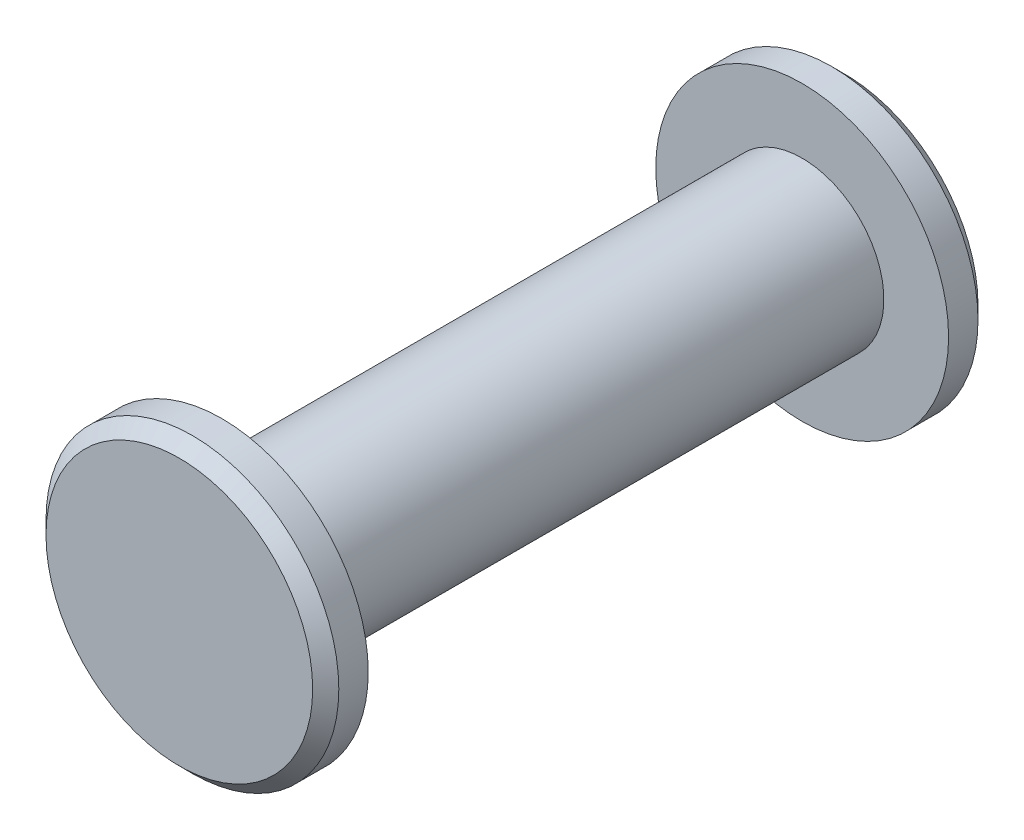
ISO-10303-21;
HEADER;
FILE_DESCRIPTION(('STEP AP214'),'2;1');
FILE_NAME('part.step','',(''),(''),'','','');
FILE_SCHEMA(('AUTOMOTIVE_DESIGN { 1 0 10303 214 1 1 1 1 }'));
ENDSEC;
DATA;
#1=APPLICATION_CONTEXT('core data for automotive mechanical design processes');
#2=APPLICATION_PROTOCOL_DEFINITION('international standard','automotive_design',2000,#1);
#3=PRODUCT_CONTEXT('',#1,'mechanical');
#4=PRODUCT('Part','Part','',(#3));
#5=PRODUCT_RELATED_PRODUCT_CATEGORY('part','',(#4));
#6=PRODUCT_DEFINITION_FORMATION('','',#4);
#7=PRODUCT_DEFINITION_CONTEXT('part definition',#1,'design');
#8=PRODUCT_DEFINITION('design','',#6,#7);
#9=PRODUCT_DEFINITION_SHAPE('','',#8);
#10=(LENGTH_UNIT() NAMED_UNIT(*) SI_UNIT(.MILLI.,.METRE.));
#11=(NAMED_UNIT(*) PLANE_ANGLE_UNIT() SI_UNIT($,.RADIAN.));
#12=(NAMED_UNIT(*) SI_UNIT($,.STERADIAN.) SOLID_ANGLE_UNIT());
#13=UNCERTAINTY_MEASURE_WITH_UNIT(LENGTH_MEASURE(1.E-05),#10,'distance_accuracy_value','');
#14=(GEOMETRIC_REPRESENTATION_CONTEXT(3) GLOBAL_UNCERTAINTY_ASSIGNED_CONTEXT((#13)) GLOBAL_UNIT_ASSIGNED_CONTEXT((#10,
#11,#12)) REPRESENTATION_CONTEXT('',''));
#15=CARTESIAN_POINT('',(0.,0.,0.));
#16=DIRECTION('',(0.,0.,1.));
#17=DIRECTION('',(1.,0.,0.));
#18=AXIS2_PLACEMENT_3D('',#15,#16,#17);
#19=CARTESIAN_POINT('',(0.,0.,5.6388));
#20=DIRECTION('',(0.,0.,-1.));
#21=DIRECTION('',(-1.,0.,0.));
#22=AXIS2_PLACEMENT_3D('',#19,#20,#21);
#23=CYLINDRICAL_SURFACE('',#22,1.5875);
#24=CARTESIAN_POINT('',(0.,0.,5.6388));
#25=DIRECTION('',(0.,0.,1.));
#26=DIRECTION('',(1.,0.,0.));
#27=AXIS2_PLACEMENT_3D('',#24,#25,#26);
#28=CIRCLE('',#27,1.5875);
#29=CARTESIAN_POINT('',(1.5875,0.,5.6388));
#30=VERTEX_POINT('',#29);
#31=EDGE_CURVE('E54',#30,#30,#28,.T.);
#32=ORIENTED_EDGE('',*,*,#31,.F.);
#33=EDGE_LOOP('',(#32));
#34=FACE_BOUND('',#33,.T.);
#35=CARTESIAN_POINT('',(0.,0.,-5.6388));
#36=DIRECTION('',(0.,0.,-1.));
#37=DIRECTION('',(-1.,0.,0.));
#38=AXIS2_PLACEMENT_3D('',#35,#36,#37);
#39=CIRCLE('',#38,1.5875);
#40=CARTESIAN_POINT('',(-1.5875,0.,-5.6388));
#41=VERTEX_POINT('',#40);
#42=EDGE_CURVE('E60',#41,#41,#39,.T.);
#43=ORIENTED_EDGE('',*,*,#42,.F.);
#44=EDGE_LOOP('',(#43));
#45=FACE_BOUND('',#44,.T.);
#46=ADVANCED_FACE('F34',(#34,#45),#23,.T.);
#47=CARTESIAN_POINT('',(0.,0.,5.6388));
#48=DIRECTION('',(0.,0.,1.));
#49=DIRECTION('',(1.,0.,0.));
#50=AXIS2_PLACEMENT_3D('',#47,#48,#49);
#51=PLANE('',#50);
#52=CARTESIAN_POINT('',(0.,0.,5.6388));
#53=DIRECTION('',(0.,0.,1.));
#54=DIRECTION('',(1.,0.,0.));
#55=AXIS2_PLACEMENT_3D('',#52,#53,#54);
#56=CIRCLE('',#55,2.8448);
#57=CARTESIAN_POINT('',(-2.8448,0.,5.6388));
#58=VERTEX_POINT('',#57);
#59=EDGE_CURVE('E57',#58,#58,#56,.T.);
#60=ORIENTED_EDGE('',*,*,#59,.F.);
#61=EDGE_LOOP('',(#60));
#62=FACE_BOUND('',#61,.T.);
#63=ORIENTED_EDGE('',*,*,#31,.T.);
#64=EDGE_LOOP('',(#63));
#65=FACE_BOUND('',#64,.T.);
#66=ADVANCED_FACE('F77',(#62,#65),#51,.F.);
#67=CARTESIAN_POINT('',(0.,0.,6.4643));
#68=DIRECTION('',(0.,0.,-1.));
#69=DIRECTION('',(-1.,0.,0.));
#70=AXIS2_PLACEMENT_3D('',#67,#68,#69);
#71=CYLINDRICAL_SURFACE('',#70,2.8448);
#72=CARTESIAN_POINT('',(0.,0.,6.21030000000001));
#73=DIRECTION('',(0.,0.,1.));
#74=DIRECTION('',(1.,0.,0.));
#75=AXIS2_PLACEMENT_3D('',#72,#73,#74);
#76=CIRCLE('',#75,2.8448);
#77=CARTESIAN_POINT('',(-2.8448,0.,6.21030000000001));
#78=VERTEX_POINT('',#77);
#79=EDGE_CURVE('E10',#78,#78,#76,.F.);
#80=CARTESIAN_POINT('',(-2.8448,0.,6.21030000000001));
#81=CARTESIAN_POINT('',(-2.8448,0.,6.20434687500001));
#82=CARTESIAN_POINT('',(-2.8448,0.,6.19839375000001));
#83=CARTESIAN_POINT('',(-2.8448,0.,6.1864875));
#84=CARTESIAN_POINT('',(-2.8448,0.,6.18053437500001));
#85=CARTESIAN_POINT('',(-2.8448,0.,6.16862812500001));
#86=CARTESIAN_POINT('',(-2.8448,0.,6.16267500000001));
#87=CARTESIAN_POINT('',(-2.8448,0.,6.15076875));
#88=CARTESIAN_POINT('',(-2.8448,0.,6.144815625));
#89=CARTESIAN_POINT('',(-2.8448,0.,6.132909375));
#90=CARTESIAN_POINT('',(-2.8448,0.,6.12695625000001));
#91=CARTESIAN_POINT('',(-2.8448,0.,6.11505));
#92=CARTESIAN_POINT('',(-2.8448,0.,6.109096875));
#93=CARTESIAN_POINT('',(-2.8448,0.,6.097190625));
#94=CARTESIAN_POINT('',(-2.8448,0.,6.09123750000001));
#95=CARTESIAN_POINT('',(-2.8448,0.,6.07933125));
#96=CARTESIAN_POINT('',(-2.8448,0.,6.073378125));
#97=CARTESIAN_POINT('',(-2.8448,0.,6.061471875));
#98=CARTESIAN_POINT('',(-2.8448,0.,6.05551875));
#99=CARTESIAN_POINT('',(-2.8448,0.,6.0436125));
#100=CARTESIAN_POINT('',(-2.8448,0.,6.037659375));
#101=CARTESIAN_POINT('',(-2.8448,0.,6.025753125));
#102=CARTESIAN_POINT('',(-2.8448,0.,6.0198));
#103=CARTESIAN_POINT('',(-2.8448,0.,6.00789375));
#104=CARTESIAN_POINT('',(-2.8448,0.,6.001940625));
#105=CARTESIAN_POINT('',(-2.8448,0.,5.990034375));
#106=CARTESIAN_POINT('',(-2.8448,0.,5.98408125));
#107=CARTESIAN_POINT('',(-2.8448,0.,5.972175));
#108=CARTESIAN_POINT('',(-2.8448,0.,5.966221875));
#109=CARTESIAN_POINT('',(-2.8448,0.,5.954315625));
#110=CARTESIAN_POINT('',(-2.8448,0.,5.9483625));
#111=CARTESIAN_POINT('',(-2.8448,0.,5.93645625));
#112=CARTESIAN_POINT('',(-2.8448,0.,5.930503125));
#113=CARTESIAN_POINT('',(-2.8448,0.,5.918596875));
#114=CARTESIAN_POINT('',(-2.8448,0.,5.91264375));
#115=CARTESIAN_POINT('',(-2.8448,0.,5.9007375));
#116=CARTESIAN_POINT('',(-2.8448,0.,5.894784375));
#117=CARTESIAN_POINT('',(-2.8448,0.,5.882878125));
#118=CARTESIAN_POINT('',(-2.8448,0.,5.876925));
#119=CARTESIAN_POINT('',(-2.8448,0.,5.86501875));
#120=CARTESIAN_POINT('',(-2.8448,0.,5.859065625));
#121=CARTESIAN_POINT('',(-2.8448,0.,5.847159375));
#122=CARTESIAN_POINT('',(-2.8448,0.,5.84120625));
#123=CARTESIAN_POINT('',(-2.8448,0.,5.8293));
#124=CARTESIAN_POINT('',(-2.8448,0.,5.823346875));
#125=CARTESIAN_POINT('',(-2.8448,0.,5.811440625));
#126=CARTESIAN_POINT('',(-2.8448,0.,5.8054875));
#127=CARTESIAN_POINT('',(-2.8448,0.,5.79358125));
#128=CARTESIAN_POINT('',(-2.8448,0.,5.787628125));
#129=CARTESIAN_POINT('',(-2.8448,0.,5.775721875));
#130=CARTESIAN_POINT('',(-2.8448,0.,5.76976875));
#131=CARTESIAN_POINT('',(-2.8448,0.,5.7578625));
#132=CARTESIAN_POINT('',(-2.8448,0.,5.751909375));
#133=CARTESIAN_POINT('',(-2.8448,0.,5.740003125));
#134=CARTESIAN_POINT('',(-2.8448,0.,5.73405));
#135=CARTESIAN_POINT('',(-2.8448,0.,5.72214375));
#136=CARTESIAN_POINT('',(-2.8448,0.,5.716190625));
#137=CARTESIAN_POINT('',(-2.8448,0.,5.704284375));
#138=CARTESIAN_POINT('',(-2.8448,0.,5.69833125));
#139=CARTESIAN_POINT('',(-2.8448,0.,5.686425));
#140=CARTESIAN_POINT('',(-2.8448,0.,5.680471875));
#141=CARTESIAN_POINT('',(-2.8448,0.,5.668565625));
#142=CARTESIAN_POINT('',(-2.8448,0.,5.6626125));
#143=CARTESIAN_POINT('',(-2.8448,0.,5.65070625));
#144=CARTESIAN_POINT('',(-2.8448,0.,5.644753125));
#145=CARTESIAN_POINT('',(-2.8448,0.,5.6388));
#146=B_SPLINE_CURVE_WITH_KNOTS('',3,(#80,#81,#82,#83,#84,#85,#86,#87,#88,#89,#90,#91,#92,#93,
#94,#95,#96,#97,#98,#99,#100,#101,#102,#103,#104,#105,#106,#107,#108,#109,#110,#111,#112,#113,
#114,#115,#116,#117,#118,#119,#120,#121,#122,#123,#124,#125,#126,#127,#128,#129,#130,#131,#132,
#133,#134,#135,#136,#137,#138,#139,#140,#141,#142,#143,#144,#145),.UNSPECIFIED.,.F.,.F.,(4,2,2,
2,2,2,2,2,2,2,2,2,2,2,2,2,2,2,2,2,2,2,2,2,2,2,2,2,2,2,2,2,4),(0.,0.0178593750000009,
0.035718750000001,0.0535781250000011,0.0714375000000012,0.0892968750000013,0.107156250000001,
0.125015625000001,0.142875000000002,0.160734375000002,0.178593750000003,0.196453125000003,
0.214312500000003,0.232171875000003,0.250031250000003,0.267890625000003,0.285750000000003,
0.303609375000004,0.321468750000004,0.339328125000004,0.357187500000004,0.375046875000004,
0.392906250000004,0.410765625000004,0.428625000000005,0.446484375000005,0.464343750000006,
0.482203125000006,0.500062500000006,0.517921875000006,0.535781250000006,0.553640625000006,
0.571500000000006),.UNSPECIFIED.);
#147=EDGE_CURVE('BSEAM83',#78,#58,#146,.T.);
#148=ORIENTED_EDGE('',*,*,#79,.T.);
#149=ORIENTED_EDGE('',*,*,#59,.T.);
#150=ORIENTED_EDGE('',*,*,#147,.T.);
#151=ORIENTED_EDGE('',*,*,#147,.F.);
#152=EDGE_LOOP('',(#148,#150,#149,#151));
#153=FACE_BOUND('',#152,.T.);
#154=ADVANCED_FACE('F83',(#153),#71,.T.);
#155=CARTESIAN_POINT('',(0.,0.,6.4643));
#156=DIRECTION('',(0.,0.,1.));
#157=DIRECTION('',(1.,0.,0.));
#158=AXIS2_PLACEMENT_3D('',#155,#156,#157);
#159=PLANE('',#158);
#160=CARTESIAN_POINT('',(0.,0.,6.4643));
#161=DIRECTION('',(0.,0.,1.));
#162=DIRECTION('',(1.,0.,0.));
#163=AXIS2_PLACEMENT_3D('',#160,#161,#162);
#164=CIRCLE('',#163,2.59080000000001);
#165=CARTESIAN_POINT('',(2.59080000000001,0.,6.4643));
#166=VERTEX_POINT('',#165);
#167=EDGE_CURVE('E41',#166,#166,#164,.T.);
#168=ORIENTED_EDGE('',*,*,#167,.T.);
#169=EDGE_LOOP('',(#168));
#170=FACE_BOUND('',#169,.T.);
#171=ADVANCED_FACE('F72',(#170),#159,.T.);
#172=CARTESIAN_POINT('',(0.,0.,-5.6388));
#173=DIRECTION('',(0.,0.,-1.));
#174=DIRECTION('',(-1.,0.,0.));
#175=AXIS2_PLACEMENT_3D('',#172,#173,#174);
#176=PLANE('',#175);
#177=CARTESIAN_POINT('',(0.,0.,-5.6388));
#178=DIRECTION('',(0.,0.,-1.));
#179=DIRECTION('',(-1.,0.,0.));
#180=AXIS2_PLACEMENT_3D('',#177,#178,#179);
#181=CIRCLE('',#180,2.8448);
#182=CARTESIAN_POINT('',(2.8448,0.,-5.6388));
#183=VERTEX_POINT('',#182);
#184=EDGE_CURVE('E63',#183,#183,#181,.T.);
#185=ORIENTED_EDGE('',*,*,#184,.F.);
#186=EDGE_LOOP('',(#185));
#187=FACE_BOUND('',#186,.T.);
#188=ORIENTED_EDGE('',*,*,#42,.T.);
#189=EDGE_LOOP('',(#188));
#190=FACE_BOUND('',#189,.T.);
#191=ADVANCED_FACE('F69',(#187,#190),#176,.F.);
#192=CARTESIAN_POINT('',(0.,0.,-6.4643));
#193=DIRECTION('',(0.,0.,1.));
#194=DIRECTION('',(1.,0.,0.));
#195=AXIS2_PLACEMENT_3D('',#192,#193,#194);
#196=CYLINDRICAL_SURFACE('',#195,2.8448);
#197=CARTESIAN_POINT('',(0.,0.,-6.21030000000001));
#198=DIRECTION('',(0.,0.,-1.));
#199=DIRECTION('',(-1.,0.,0.));
#200=AXIS2_PLACEMENT_3D('',#197,#198,#199);
#201=CIRCLE('',#200,2.8448);
#202=CARTESIAN_POINT('',(2.8448,0.,-6.21030000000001));
#203=VERTEX_POINT('',#202);
#204=EDGE_CURVE('E45',#203,#203,#201,.F.);
#205=CARTESIAN_POINT('',(2.8448,0.,-6.21030000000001));
#206=CARTESIAN_POINT('',(2.8448,0.,-6.20434687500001));
#207=CARTESIAN_POINT('',(2.8448,0.,-6.19839375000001));
#208=CARTESIAN_POINT('',(2.8448,0.,-6.1864875));
#209=CARTESIAN_POINT('',(2.8448,0.,-6.18053437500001));
#210=CARTESIAN_POINT('',(2.8448,0.,-6.16862812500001));
#211=CARTESIAN_POINT('',(2.8448,0.,-6.16267500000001));
#212=CARTESIAN_POINT('',(2.8448,0.,-6.15076875));
#213=CARTESIAN_POINT('',(2.8448,0.,-6.144815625));
#214=CARTESIAN_POINT('',(2.8448,0.,-6.132909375));
#215=CARTESIAN_POINT('',(2.8448,0.,-6.12695625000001));
#216=CARTESIAN_POINT('',(2.8448,0.,-6.11505));
#217=CARTESIAN_POINT('',(2.8448,0.,-6.109096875));
#218=CARTESIAN_POINT('',(2.8448,0.,-6.097190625));
#219=CARTESIAN_POINT('',(2.8448,0.,-6.09123750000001));
#220=CARTESIAN_POINT('',(2.8448,0.,-6.07933125));
#221=CARTESIAN_POINT('',(2.8448,0.,-6.073378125));
#222=CARTESIAN_POINT('',(2.8448,0.,-6.061471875));
#223=CARTESIAN_POINT('',(2.8448,0.,-6.05551875));
#224=CARTESIAN_POINT('',(2.8448,0.,-6.0436125));
#225=CARTESIAN_POINT('',(2.8448,0.,-6.037659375));
#226=CARTESIAN_POINT('',(2.8448,0.,-6.025753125));
#227=CARTESIAN_POINT('',(2.8448,0.,-6.0198));
#228=CARTESIAN_POINT('',(2.8448,0.,-6.00789375));
#229=CARTESIAN_POINT('',(2.8448,0.,-6.001940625));
#230=CARTESIAN_POINT('',(2.8448,0.,-5.990034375));
#231=CARTESIAN_POINT('',(2.8448,0.,-5.98408125));
#232=CARTESIAN_POINT('',(2.8448,0.,-5.972175));
#233=CARTESIAN_POINT('',(2.8448,0.,-5.966221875));
#234=CARTESIAN_POINT('',(2.8448,0.,-5.954315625));
#235=CARTESIAN_POINT('',(2.8448,0.,-5.9483625));
#236=CARTESIAN_POINT('',(2.8448,0.,-5.93645625));
#237=CARTESIAN_POINT('',(2.8448,0.,-5.930503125));
#238=CARTESIAN_POINT('',(2.8448,0.,-5.918596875));
#239=CARTESIAN_POINT('',(2.8448,0.,-5.91264375));
#240=CARTESIAN_POINT('',(2.8448,0.,-5.9007375));
#241=CARTESIAN_POINT('',(2.8448,0.,-5.894784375));
#242=CARTESIAN_POINT('',(2.8448,0.,-5.882878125));
#243=CARTESIAN_POINT('',(2.8448,0.,-5.876925));
#244=CARTESIAN_POINT('',(2.8448,0.,-5.86501875));
#245=CARTESIAN_POINT('',(2.8448,0.,-5.859065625));
#246=CARTESIAN_POINT('',(2.8448,0.,-5.847159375));
#247=CARTESIAN_POINT('',(2.8448,0.,-5.84120625));
#248=CARTESIAN_POINT('',(2.8448,0.,-5.8293));
#249=CARTESIAN_POINT('',(2.8448,0.,-5.823346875));
#250=CARTESIAN_POINT('',(2.8448,0.,-5.811440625));
#251=CARTESIAN_POINT('',(2.8448,0.,-5.8054875));
#252=CARTESIAN_POINT('',(2.8448,0.,-5.79358125));
#253=CARTESIAN_POINT('',(2.8448,0.,-5.787628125));
#254=CARTESIAN_POINT('',(2.8448,0.,-5.775721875));
#255=CARTESIAN_POINT('',(2.8448,0.,-5.76976875));
#256=CARTESIAN_POINT('',(2.8448,0.,-5.7578625));
#257=CARTESIAN_POINT('',(2.8448,0.,-5.751909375));
#258=CARTESIAN_POINT('',(2.8448,0.,-5.740003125));
#259=CARTESIAN_POINT('',(2.8448,0.,-5.73405));
#260=CARTESIAN_POINT('',(2.8448,0.,-5.72214375));
#261=CARTESIAN_POINT('',(2.8448,0.,-5.716190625));
#262=CARTESIAN_POINT('',(2.8448,0.,-5.704284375));
#263=CARTESIAN_POINT('',(2.8448,0.,-5.69833125));
#264=CARTESIAN_POINT('',(2.8448,0.,-5.686425));
#265=CARTESIAN_POINT('',(2.8448,0.,-5.680471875));
#266=CARTESIAN_POINT('',(2.8448,0.,-5.668565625));
#267=CARTESIAN_POINT('',(2.8448,0.,-5.6626125));
#268=CARTESIAN_POINT('',(2.8448,0.,-5.65070625));
#269=CARTESIAN_POINT('',(2.8448,0.,-5.644753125));
#270=CARTESIAN_POINT('',(2.8448,0.,-5.6388));
#271=B_SPLINE_CURVE_WITH_KNOTS('',3,(#205,#206,#207,#208,#209,#210,#211,#212,#213,#214,#215,
#216,#217,#218,#219,#220,#221,#222,#223,#224,#225,#226,#227,#228,#229,#230,#231,#232,#233,#234,
#235,#236,#237,#238,#239,#240,#241,#242,#243,#244,#245,#246,#247,#248,#249,#250,#251,#252,#253,
#254,#255,#256,#257,#258,#259,#260,#261,#262,#263,#264,#265,#266,#267,#268,#269,#270),
.UNSPECIFIED.,.F.,.F.,(4,2,2,2,2,2,2,2,2,2,2,2,2,2,2,2,2,2,2,2,2,2,2,2,2,2,2,2,2,2,2,2,4),(0.,
0.0178593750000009,0.035718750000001,0.0535781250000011,0.0714375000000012,0.0892968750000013,
0.107156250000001,0.125015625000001,0.142875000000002,0.160734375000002,0.178593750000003,
0.196453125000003,0.214312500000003,0.232171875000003,0.250031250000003,0.267890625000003,
0.285750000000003,0.303609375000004,0.321468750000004,0.339328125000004,0.357187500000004,
0.375046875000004,0.392906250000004,0.410765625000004,0.428625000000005,0.446484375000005,
0.464343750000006,0.482203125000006,0.500062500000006,0.517921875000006,0.535781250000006,
0.553640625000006,0.571500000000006),.UNSPECIFIED.);
#272=EDGE_CURVE('BSEAM67',#203,#183,#271,.T.);
#273=ORIENTED_EDGE('',*,*,#204,.T.);
#274=ORIENTED_EDGE('',*,*,#184,.T.);
#275=ORIENTED_EDGE('',*,*,#272,.T.);
#276=ORIENTED_EDGE('',*,*,#272,.F.);
#277=EDGE_LOOP('',(#273,#275,#274,#276));
#278=FACE_BOUND('',#277,.T.);
#279=ADVANCED_FACE('F67',(#278),#196,.T.);
#280=CARTESIAN_POINT('',(0.,0.,-6.4643));
#281=DIRECTION('',(0.,0.,-1.));
#282=DIRECTION('',(-1.,0.,0.));
#283=AXIS2_PLACEMENT_3D('',#280,#281,#282);
#284=PLANE('',#283);
#285=CARTESIAN_POINT('',(0.,0.,-6.4643));
#286=DIRECTION('',(0.,0.,-1.));
#287=DIRECTION('',(-1.,0.,0.));
#288=AXIS2_PLACEMENT_3D('',#285,#286,#287);
#289=CIRCLE('',#288,2.59080000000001);
#290=CARTESIAN_POINT('',(-2.59080000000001,0.,-6.4643));
#291=VERTEX_POINT('',#290);
#292=EDGE_CURVE('E49',#291,#291,#289,.T.);
#293=ORIENTED_EDGE('',*,*,#292,.T.);
#294=EDGE_LOOP('',(#293));
#295=FACE_BOUND('',#294,.T.);
#296=ADVANCED_FACE('F90',(#295),#284,.T.);
#297=CARTESIAN_POINT('',(0.,0.,-6.4643));
#298=DIRECTION('',(0.,0.,1.));
#299=DIRECTION('',(1.,0.,0.));
#300=AXIS2_PLACEMENT_3D('',#297,#298,#299);
#301=CONICAL_SURFACE('',#300,2.59080000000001,0.785398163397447);
#302=ORIENTED_EDGE('',*,*,#204,.F.);
#303=EDGE_LOOP('',(#302));
#304=FACE_BOUND('',#303,.T.);
#305=ORIENTED_EDGE('',*,*,#292,.F.);
#306=EDGE_LOOP('',(#305));
#307=FACE_BOUND('',#306,.T.);
#308=ADVANCED_FACE('F88',(#304,#307),#301,.T.);
#309=CARTESIAN_POINT('',(0.,0.,6.4643));
#310=DIRECTION('',(0.,0.,-1.));
#311=DIRECTION('',(-1.,0.,0.));
#312=AXIS2_PLACEMENT_3D('',#309,#310,#311);
#313=CONICAL_SURFACE('',#312,2.59080000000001,0.785398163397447);
#314=ORIENTED_EDGE('',*,*,#79,.F.);
#315=EDGE_LOOP('',(#314));
#316=FACE_BOUND('',#315,.T.);
#317=ORIENTED_EDGE('',*,*,#167,.F.);
#318=EDGE_LOOP('',(#317));
#319=FACE_BOUND('',#318,.T.);
#320=ADVANCED_FACE('F36',(#316,#319),#313,.T.);
#321=CLOSED_SHELL('',(#46,#66,#154,#171,#191,#279,#296,#308,#320));
#322=MANIFOLD_SOLID_BREP('B2',#321);
#323=ADVANCED_BREP_SHAPE_REPRESENTATION('',(#18,#322),#14);
#324=SHAPE_DEFINITION_REPRESENTATION(#9,#323);
ENDSEC;
END-ISO-10303-21;
